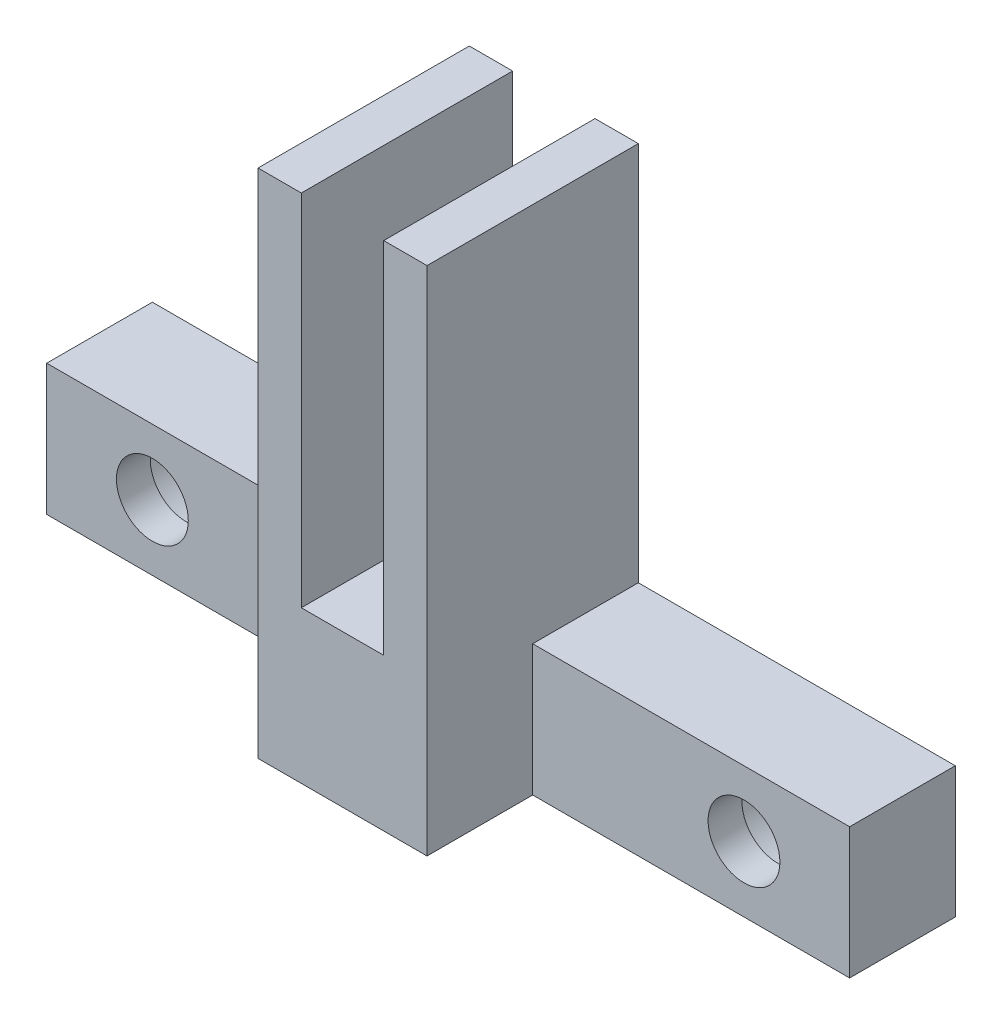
ISO-10303-21;
HEADER;
FILE_DESCRIPTION(('STEP AP214'),'2;1');
FILE_NAME('part.step','',(''),(''),'','','');
FILE_SCHEMA(('AUTOMOTIVE_DESIGN { 1 0 10303 214 1 1 1 1 }'));
ENDSEC;
DATA;
#1=APPLICATION_CONTEXT('core data for automotive mechanical design processes');
#2=APPLICATION_PROTOCOL_DEFINITION('international standard','automotive_design',2000,#1);
#3=PRODUCT_CONTEXT('',#1,'mechanical');
#4=PRODUCT('Part','Part','',(#3));
#5=PRODUCT_RELATED_PRODUCT_CATEGORY('part','',(#4));
#6=PRODUCT_DEFINITION_FORMATION('','',#4);
#7=PRODUCT_DEFINITION_CONTEXT('part definition',#1,'design');
#8=PRODUCT_DEFINITION('design','',#6,#7);
#9=PRODUCT_DEFINITION_SHAPE('','',#8);
#10=(LENGTH_UNIT() NAMED_UNIT(*) SI_UNIT(.MILLI.,.METRE.));
#11=(NAMED_UNIT(*) PLANE_ANGLE_UNIT() SI_UNIT($,.RADIAN.));
#12=(NAMED_UNIT(*) SI_UNIT($,.STERADIAN.) SOLID_ANGLE_UNIT());
#13=UNCERTAINTY_MEASURE_WITH_UNIT(LENGTH_MEASURE(1.E-05),#10,'distance_accuracy_value','');
#14=(GEOMETRIC_REPRESENTATION_CONTEXT(3) GLOBAL_UNCERTAINTY_ASSIGNED_CONTEXT((#13)) GLOBAL_UNIT_ASSIGNED_CONTEXT((#10,
#11,#12)) REPRESENTATION_CONTEXT('',''));
#15=CARTESIAN_POINT('',(0.,0.,0.));
#16=DIRECTION('',(0.,0.,1.));
#17=DIRECTION('',(1.,0.,0.));
#18=AXIS2_PLACEMENT_3D('',#15,#16,#17);
#19=CARTESIAN_POINT('',(-79.4828612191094,46.4290601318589,10.));
#20=DIRECTION('',(1.,0.,0.));
#21=DIRECTION('',(0.,0.,-1.));
#22=AXIS2_PLACEMENT_3D('',#19,#20,#21);
#23=PLANE('',#22);
#24=DIRECTION('',(0.,-1.,0.));
#25=VECTOR('',#24,1.);
#26=CARTESIAN_POINT('',(-79.4828612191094,46.4290601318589,0.));
#27=LINE('',#26,#25);
#28=CARTESIAN_POINT('',(-79.4828612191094,46.4290601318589,0.));
#29=VERTEX_POINT('',#28);
#30=CARTESIAN_POINT('',(-79.4828612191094,28.4290601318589,0.));
#31=VERTEX_POINT('',#30);
#32=EDGE_CURVE('E215',#29,#31,#27,.T.);
#33=ORIENTED_EDGE('',*,*,#32,.T.);
#34=DIRECTION('',(0.,0.,-1.));
#35=VECTOR('',#34,1.);
#36=CARTESIAN_POINT('',(-79.4828612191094,28.4290601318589,10.));
#37=LINE('',#36,#35);
#38=CARTESIAN_POINT('',(-79.4828612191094,28.4290601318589,5.));
#39=VERTEX_POINT('',#38);
#40=EDGE_CURVE('E11',#39,#31,#37,.T.);
#41=ORIENTED_EDGE('',*,*,#40,.F.);
#42=DIRECTION('',(0.,1.,0.));
#43=VECTOR('',#42,1.);
#44=CARTESIAN_POINT('',(-79.4828612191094,22.2290601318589,5.));
#45=LINE('',#44,#43);
#46=CARTESIAN_POINT('',(-79.4828612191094,22.2290601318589,5.));
#47=VERTEX_POINT('',#46);
#48=EDGE_CURVE('E172',#47,#39,#45,.T.);
#49=ORIENTED_EDGE('',*,*,#48,.F.);
#50=DIRECTION('',(0.,0.,-1.));
#51=VECTOR('',#50,1.);
#52=CARTESIAN_POINT('',(-79.4828612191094,22.2290601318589,10.));
#53=LINE('',#52,#51);
#54=CARTESIAN_POINT('',(-79.4828612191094,22.2290601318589,10.));
#55=VERTEX_POINT('',#54);
#56=EDGE_CURVE('E169',#55,#47,#53,.T.);
#57=ORIENTED_EDGE('',*,*,#56,.F.);
#58=DIRECTION('',(0.,-1.,0.));
#59=VECTOR('',#58,1.);
#60=CARTESIAN_POINT('',(-79.4828612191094,46.4290601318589,10.));
#61=LINE('',#60,#59);
#62=CARTESIAN_POINT('',(-79.4828612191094,46.4290601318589,10.));
#63=VERTEX_POINT('',#62);
#64=EDGE_CURVE('E270',#63,#55,#61,.T.);
#65=ORIENTED_EDGE('',*,*,#64,.F.);
#66=DIRECTION('',(0.,0.,-1.));
#67=VECTOR('',#66,1.);
#68=CARTESIAN_POINT('',(-79.4828612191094,46.4290601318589,10.));
#69=LINE('',#68,#67);
#70=EDGE_CURVE('E260',#63,#29,#69,.T.);
#71=ORIENTED_EDGE('',*,*,#70,.T.);
#72=EDGE_LOOP('',(#33,#41,#49,#57,#65,#71));
#73=FACE_BOUND('',#72,.T.);
#74=ADVANCED_FACE('F16',(#73),#23,.F.);
#75=CARTESIAN_POINT('',(-71.4828612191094,46.4290601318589,10.));
#76=DIRECTION('',(-1.,0.,0.));
#77=DIRECTION('',(0.,0.,1.));
#78=AXIS2_PLACEMENT_3D('',#75,#76,#77);
#79=PLANE('',#78);
#80=DIRECTION('',(0.,1.,0.));
#81=VECTOR('',#80,1.);
#82=CARTESIAN_POINT('',(-71.4828612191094,46.4290601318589,0.));
#83=LINE('',#82,#81);
#84=CARTESIAN_POINT('',(-71.4828612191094,28.4290601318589,0.));
#85=VERTEX_POINT('',#84);
#86=CARTESIAN_POINT('',(-71.4828612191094,46.4290601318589,0.));
#87=VERTEX_POINT('',#86);
#88=EDGE_CURVE('E232',#85,#87,#83,.T.);
#89=ORIENTED_EDGE('',*,*,#88,.T.);
#90=DIRECTION('',(0.,0.,-1.));
#91=VECTOR('',#90,1.);
#92=CARTESIAN_POINT('',(-71.4828612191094,46.4290601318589,10.));
#93=LINE('',#92,#91);
#94=CARTESIAN_POINT('',(-71.4828612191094,46.4290601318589,10.));
#95=VERTEX_POINT('',#94);
#96=EDGE_CURVE('E279',#95,#87,#93,.T.);
#97=ORIENTED_EDGE('',*,*,#96,.F.);
#98=DIRECTION('',(0.,1.,0.));
#99=VECTOR('',#98,1.);
#100=CARTESIAN_POINT('',(-71.4828612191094,46.4290601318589,10.));
#101=LINE('',#100,#99);
#102=CARTESIAN_POINT('',(-71.4828612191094,22.2290601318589,10.));
#103=VERTEX_POINT('',#102);
#104=EDGE_CURVE('E72',#103,#95,#101,.T.);
#105=ORIENTED_EDGE('',*,*,#104,.F.);
#106=DIRECTION('',(0.,0.,1.));
#107=VECTOR('',#106,1.);
#108=CARTESIAN_POINT('',(-71.4828612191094,22.2290601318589,10.));
#109=LINE('',#108,#107);
#110=CARTESIAN_POINT('',(-71.4828612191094,22.2290601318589,5.));
#111=VERTEX_POINT('',#110);
#112=EDGE_CURVE('E175',#111,#103,#109,.T.);
#113=ORIENTED_EDGE('',*,*,#112,.F.);
#114=DIRECTION('',(0.,1.,0.));
#115=VECTOR('',#114,1.);
#116=CARTESIAN_POINT('',(-71.4828612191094,22.2290601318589,5.));
#117=LINE('',#116,#115);
#118=CARTESIAN_POINT('',(-71.4828612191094,28.4290601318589,5.));
#119=VERTEX_POINT('',#118);
#120=EDGE_CURVE('E178',#111,#119,#117,.T.);
#121=ORIENTED_EDGE('',*,*,#120,.T.);
#122=DIRECTION('',(0.,0.,-1.));
#123=VECTOR('',#122,1.);
#124=CARTESIAN_POINT('',(-71.4828612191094,28.4290601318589,10.));
#125=LINE('',#124,#123);
#126=EDGE_CURVE('E24',#119,#85,#125,.T.);
#127=ORIENTED_EDGE('',*,*,#126,.T.);
#128=EDGE_LOOP('',(#89,#97,#105,#113,#121,#127));
#129=FACE_BOUND('',#128,.T.);
#130=ADVANCED_FACE('F301',(#129),#79,.F.);
#131=CARTESIAN_POINT('',(-73.5328612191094,46.4290601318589,10.));
#132=DIRECTION('',(0.,-1.,0.));
#133=DIRECTION('',(0.,0.,-1.));
#134=AXIS2_PLACEMENT_3D('',#131,#132,#133);
#135=PLANE('',#134);
#136=DIRECTION('',(-1.,0.,0.));
#137=VECTOR('',#136,1.);
#138=CARTESIAN_POINT('',(-73.5328612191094,46.4290601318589,0.));
#139=LINE('',#138,#137);
#140=CARTESIAN_POINT('',(-73.5328612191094,46.4290601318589,0.));
#141=VERTEX_POINT('',#140);
#142=EDGE_CURVE('E262',#87,#141,#139,.T.);
#143=ORIENTED_EDGE('',*,*,#142,.T.);
#144=DIRECTION('',(0.,0.,-1.));
#145=VECTOR('',#144,1.);
#146=CARTESIAN_POINT('',(-73.5328612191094,46.4290601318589,10.));
#147=LINE('',#146,#145);
#148=CARTESIAN_POINT('',(-73.5328612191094,46.4290601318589,10.));
#149=VERTEX_POINT('',#148);
#150=EDGE_CURVE('E284',#149,#141,#147,.T.);
#151=ORIENTED_EDGE('',*,*,#150,.F.);
#152=DIRECTION('',(-1.,0.,0.));
#153=VECTOR('',#152,1.);
#154=CARTESIAN_POINT('',(-73.5328612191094,46.4290601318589,10.));
#155=LINE('',#154,#153);
#156=EDGE_CURVE('E131',#95,#149,#155,.T.);
#157=ORIENTED_EDGE('',*,*,#156,.F.);
#158=ORIENTED_EDGE('',*,*,#96,.T.);
#159=EDGE_LOOP('',(#143,#151,#157,#158));
#160=FACE_BOUND('',#159,.T.);
#161=ADVANCED_FACE('F303',(#160),#135,.F.);
#162=CARTESIAN_POINT('',(-73.5328612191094,46.4290601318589,10.));
#163=DIRECTION('',(1.,0.,0.));
#164=DIRECTION('',(0.,0.,-1.));
#165=AXIS2_PLACEMENT_3D('',#162,#163,#164);
#166=PLANE('',#165);
#167=DIRECTION('',(0.,-1.,0.));
#168=VECTOR('',#167,1.);
#169=CARTESIAN_POINT('',(-73.5328612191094,46.4290601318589,0.));
#170=LINE('',#169,#168);
#171=CARTESIAN_POINT('',(-73.5328612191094,29.4290601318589,0.));
#172=VERTEX_POINT('',#171);
#173=EDGE_CURVE('E32',#141,#172,#170,.T.);
#174=ORIENTED_EDGE('',*,*,#173,.T.);
#175=DIRECTION('',(0.,0.,-1.));
#176=VECTOR('',#175,1.);
#177=CARTESIAN_POINT('',(-73.5328612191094,29.4290601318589,10.));
#178=LINE('',#177,#176);
#179=CARTESIAN_POINT('',(-73.5328612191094,29.4290601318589,10.));
#180=VERTEX_POINT('',#179);
#181=EDGE_CURVE('E135',#180,#172,#178,.T.);
#182=ORIENTED_EDGE('',*,*,#181,.F.);
#183=DIRECTION('',(0.,-1.,0.));
#184=VECTOR('',#183,1.);
#185=CARTESIAN_POINT('',(-73.5328612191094,46.4290601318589,10.));
#186=LINE('',#185,#184);
#187=EDGE_CURVE('E126',#149,#180,#186,.T.);
#188=ORIENTED_EDGE('',*,*,#187,.F.);
#189=ORIENTED_EDGE('',*,*,#150,.T.);
#190=EDGE_LOOP('',(#174,#182,#188,#189));
#191=FACE_BOUND('',#190,.T.);
#192=ADVANCED_FACE('F136',(#191),#166,.F.);
#193=CARTESIAN_POINT('',(-77.4328612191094,46.4290601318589,10.));
#194=DIRECTION('',(-1.,0.,0.));
#195=DIRECTION('',(0.,0.,1.));
#196=AXIS2_PLACEMENT_3D('',#193,#194,#195);
#197=PLANE('',#196);
#198=DIRECTION('',(0.,1.,0.));
#199=VECTOR('',#198,1.);
#200=CARTESIAN_POINT('',(-77.4328612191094,46.4290601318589,0.));
#201=LINE('',#200,#199);
#202=CARTESIAN_POINT('',(-77.4328612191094,29.4290601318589,0.));
#203=VERTEX_POINT('',#202);
#204=CARTESIAN_POINT('',(-77.4328612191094,46.4290601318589,0.));
#205=VERTEX_POINT('',#204);
#206=EDGE_CURVE('E290',#203,#205,#201,.T.);
#207=ORIENTED_EDGE('',*,*,#206,.T.);
#208=DIRECTION('',(0.,0.,-1.));
#209=VECTOR('',#208,1.);
#210=CARTESIAN_POINT('',(-77.4328612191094,46.4290601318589,10.));
#211=LINE('',#210,#209);
#212=CARTESIAN_POINT('',(-77.4328612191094,46.4290601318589,10.));
#213=VERTEX_POINT('',#212);
#214=EDGE_CURVE('E286',#213,#205,#211,.T.);
#215=ORIENTED_EDGE('',*,*,#214,.F.);
#216=DIRECTION('',(0.,1.,0.));
#217=VECTOR('',#216,1.);
#218=CARTESIAN_POINT('',(-77.4328612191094,46.4290601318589,10.));
#219=LINE('',#218,#217);
#220=CARTESIAN_POINT('',(-77.4328612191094,29.4290601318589,10.));
#221=VERTEX_POINT('',#220);
#222=EDGE_CURVE('E133',#221,#213,#219,.T.);
#223=ORIENTED_EDGE('',*,*,#222,.F.);
#224=DIRECTION('',(0.,0.,-1.));
#225=VECTOR('',#224,1.);
#226=CARTESIAN_POINT('',(-77.4328612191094,29.4290601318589,10.));
#227=LINE('',#226,#225);
#228=EDGE_CURVE('E140',#221,#203,#227,.T.);
#229=ORIENTED_EDGE('',*,*,#228,.T.);
#230=EDGE_LOOP('',(#207,#215,#223,#229));
#231=FACE_BOUND('',#230,.T.);
#232=ADVANCED_FACE('F297',(#231),#197,.F.);
#233=CARTESIAN_POINT('',(-79.4828612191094,46.4290601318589,10.));
#234=DIRECTION('',(0.,-1.,0.));
#235=DIRECTION('',(0.,0.,-1.));
#236=AXIS2_PLACEMENT_3D('',#233,#234,#235);
#237=PLANE('',#236);
#238=DIRECTION('',(-1.,0.,0.));
#239=VECTOR('',#238,1.);
#240=CARTESIAN_POINT('',(-79.4828612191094,46.4290601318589,0.));
#241=LINE('',#240,#239);
#242=EDGE_CURVE('E65',#205,#29,#241,.T.);
#243=ORIENTED_EDGE('',*,*,#242,.T.);
#244=ORIENTED_EDGE('',*,*,#70,.F.);
#245=DIRECTION('',(-1.,0.,0.));
#246=VECTOR('',#245,1.);
#247=CARTESIAN_POINT('',(-79.4828612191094,46.4290601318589,10.));
#248=LINE('',#247,#246);
#249=EDGE_CURVE('E41',#213,#63,#248,.T.);
#250=ORIENTED_EDGE('',*,*,#249,.F.);
#251=ORIENTED_EDGE('',*,*,#214,.T.);
#252=EDGE_LOOP('',(#243,#244,#250,#251));
#253=FACE_BOUND('',#252,.T.);
#254=ADVANCED_FACE('F298',(#253),#237,.F.);
#255=CARTESIAN_POINT('',(-79.4828612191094,28.4290601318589,10.));
#256=DIRECTION('',(0.,0.,1.));
#257=DIRECTION('',(1.,0.,0.));
#258=AXIS2_PLACEMENT_3D('',#255,#256,#257);
#259=PLANE('',#258);
#260=ORIENTED_EDGE('',*,*,#187,.T.);
#261=DIRECTION('',(-1.,0.,0.));
#262=VECTOR('',#261,1.);
#263=CARTESIAN_POINT('',(-73.5328612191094,29.4290601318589,10.));
#264=LINE('',#263,#262);
#265=EDGE_CURVE('E129',#180,#221,#264,.T.);
#266=ORIENTED_EDGE('',*,*,#265,.T.);
#267=ORIENTED_EDGE('',*,*,#222,.T.);
#268=ORIENTED_EDGE('',*,*,#249,.T.);
#269=ORIENTED_EDGE('',*,*,#64,.T.);
#270=DIRECTION('',(-1.,0.,0.));
#271=VECTOR('',#270,1.);
#272=CARTESIAN_POINT('',(-68.4828612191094,22.2290601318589,10.));
#273=LINE('',#272,#271);
#274=EDGE_CURVE('E212',#103,#55,#273,.T.);
#275=ORIENTED_EDGE('',*,*,#274,.F.);
#276=ORIENTED_EDGE('',*,*,#104,.T.);
#277=ORIENTED_EDGE('',*,*,#156,.T.);
#278=EDGE_LOOP('',(#260,#266,#267,#268,#269,#275,#276,#277));
#279=FACE_BOUND('',#278,.T.);
#280=ADVANCED_FACE('F127',(#279),#259,.T.);
#281=CARTESIAN_POINT('',(-79.4828612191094,28.4290601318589,0.));
#282=DIRECTION('',(0.,0.,1.));
#283=DIRECTION('',(1.,0.,0.));
#284=AXIS2_PLACEMENT_3D('',#281,#282,#283);
#285=PLANE('',#284);
#286=CARTESIAN_POINT('',(-89.4828612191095,25.3290601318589,0.));
#287=DIRECTION('',(0.,0.,-1.));
#288=DIRECTION('',(-1.,0.,0.));
#289=AXIS2_PLACEMENT_3D('',#286,#287,#288);
#290=CIRCLE('',#289,3.);
#291=CARTESIAN_POINT('',(-92.4828612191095,25.3290601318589,0.));
#292=VERTEX_POINT('',#291);
#293=EDGE_CURVE('E149',#292,#292,#290,.T.);
#294=ORIENTED_EDGE('',*,*,#293,.F.);
#295=EDGE_LOOP('',(#294));
#296=FACE_BOUND('',#295,.T.);
#297=CARTESIAN_POINT('',(-61.4828612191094,25.3290601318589,0.));
#298=DIRECTION('',(0.,0.,-1.));
#299=DIRECTION('',(-1.,0.,0.));
#300=AXIS2_PLACEMENT_3D('',#297,#298,#299);
#301=CIRCLE('',#300,3.);
#302=CARTESIAN_POINT('',(-64.4828612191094,25.3290601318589,0.));
#303=VERTEX_POINT('',#302);
#304=EDGE_CURVE('E159',#303,#303,#301,.T.);
#305=ORIENTED_EDGE('',*,*,#304,.F.);
#306=EDGE_LOOP('',(#305));
#307=FACE_BOUND('',#306,.T.);
#308=DIRECTION('',(-1.,0.,0.));
#309=VECTOR('',#308,1.);
#310=CARTESIAN_POINT('',(-73.5328612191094,29.4290601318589,0.));
#311=LINE('',#310,#309);
#312=EDGE_CURVE('E145',#172,#203,#311,.T.);
#313=ORIENTED_EDGE('',*,*,#312,.F.);
#314=ORIENTED_EDGE('',*,*,#173,.F.);
#315=ORIENTED_EDGE('',*,*,#142,.F.);
#316=ORIENTED_EDGE('',*,*,#88,.F.);
#317=DIRECTION('',(1.,0.,0.));
#318=VECTOR('',#317,1.);
#319=CARTESIAN_POINT('',(-79.4828612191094,28.4290601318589,0.));
#320=LINE('',#319,#318);
#321=CARTESIAN_POINT('',(-56.4828612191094,28.4290601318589,0.));
#322=VERTEX_POINT('',#321);
#323=EDGE_CURVE('E203',#85,#322,#320,.T.);
#324=ORIENTED_EDGE('',*,*,#323,.T.);
#325=DIRECTION('',(0.,-1.,0.));
#326=VECTOR('',#325,1.);
#327=CARTESIAN_POINT('',(-56.4828612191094,28.4290601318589,0.));
#328=LINE('',#327,#326);
#329=CARTESIAN_POINT('',(-56.4828612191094,22.2290601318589,0.));
#330=VERTEX_POINT('',#329);
#331=EDGE_CURVE('E186',#322,#330,#328,.T.);
#332=ORIENTED_EDGE('',*,*,#331,.T.);
#333=DIRECTION('',(-1.,0.,0.));
#334=VECTOR('',#333,1.);
#335=CARTESIAN_POINT('',(-68.4828612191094,22.2290601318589,0.));
#336=LINE('',#335,#334);
#337=CARTESIAN_POINT('',(-94.4828612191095,22.2290601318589,0.));
#338=VERTEX_POINT('',#337);
#339=EDGE_CURVE('E216',#330,#338,#336,.T.);
#340=ORIENTED_EDGE('',*,*,#339,.T.);
#341=DIRECTION('',(0.,1.,0.));
#342=VECTOR('',#341,1.);
#343=CARTESIAN_POINT('',(-94.4828612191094,28.4290601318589,0.));
#344=LINE('',#343,#342);
#345=CARTESIAN_POINT('',(-94.4828612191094,28.4290601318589,0.));
#346=VERTEX_POINT('',#345);
#347=EDGE_CURVE('E181',#338,#346,#344,.T.);
#348=ORIENTED_EDGE('',*,*,#347,.T.);
#349=EDGE_CURVE('E223',#346,#31,#320,.T.);
#350=ORIENTED_EDGE('',*,*,#349,.T.);
#351=ORIENTED_EDGE('',*,*,#32,.F.);
#352=ORIENTED_EDGE('',*,*,#242,.F.);
#353=ORIENTED_EDGE('',*,*,#206,.F.);
#354=EDGE_LOOP('',(#313,#314,#315,#316,#324,#332,#340,#348,#350,#351,#352,#353));
#355=FACE_BOUND('',#354,.T.);
#356=ADVANCED_FACE('F229',(#296,#307,#355),#285,.F.);
#357=CARTESIAN_POINT('',(-79.4828612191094,28.4290601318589,10.));
#358=DIRECTION('',(0.,1.,0.));
#359=DIRECTION('',(0.,0.,1.));
#360=AXIS2_PLACEMENT_3D('',#357,#358,#359);
#361=PLANE('',#360);
#362=ORIENTED_EDGE('',*,*,#126,.F.);
#363=DIRECTION('',(1.,0.,0.));
#364=VECTOR('',#363,1.);
#365=CARTESIAN_POINT('',(-94.4828612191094,28.4290601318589,5.));
#366=LINE('',#365,#364);
#367=CARTESIAN_POINT('',(-56.4828612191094,28.4290601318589,5.));
#368=VERTEX_POINT('',#367);
#369=EDGE_CURVE('E185',#119,#368,#366,.T.);
#370=ORIENTED_EDGE('',*,*,#369,.T.);
#371=DIRECTION('',(0.,0.,-1.));
#372=VECTOR('',#371,1.);
#373=CARTESIAN_POINT('',(-56.4828612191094,28.4290601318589,5.));
#374=LINE('',#373,#372);
#375=EDGE_CURVE('E207',#368,#322,#374,.T.);
#376=ORIENTED_EDGE('',*,*,#375,.T.);
#377=ORIENTED_EDGE('',*,*,#323,.F.);
#378=EDGE_LOOP('',(#362,#370,#376,#377));
#379=FACE_BOUND('',#378,.T.);
#380=ADVANCED_FACE('F236',(#379),#361,.T.);
#381=CARTESIAN_POINT('',(-68.4828612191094,22.2290601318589,10.));
#382=DIRECTION('',(0.,-1.,0.));
#383=DIRECTION('',(0.,0.,-1.));
#384=AXIS2_PLACEMENT_3D('',#381,#382,#383);
#385=PLANE('',#384);
#386=ORIENTED_EDGE('',*,*,#56,.T.);
#387=DIRECTION('',(-1.,0.,0.));
#388=VECTOR('',#387,1.);
#389=CARTESIAN_POINT('',(-94.4828612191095,22.2290601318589,5.));
#390=LINE('',#389,#388);
#391=CARTESIAN_POINT('',(-94.4828612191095,22.2290601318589,5.));
#392=VERTEX_POINT('',#391);
#393=EDGE_CURVE('E192',#47,#392,#390,.T.);
#394=ORIENTED_EDGE('',*,*,#393,.T.);
#395=DIRECTION('',(0.,0.,-1.));
#396=VECTOR('',#395,1.);
#397=CARTESIAN_POINT('',(-94.4828612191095,22.2290601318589,5.));
#398=LINE('',#397,#396);
#399=EDGE_CURVE('E200',#392,#338,#398,.T.);
#400=ORIENTED_EDGE('',*,*,#399,.T.);
#401=ORIENTED_EDGE('',*,*,#339,.F.);
#402=DIRECTION('',(0.,0.,-1.));
#403=VECTOR('',#402,1.);
#404=CARTESIAN_POINT('',(-56.4828612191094,22.2290601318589,5.));
#405=LINE('',#404,#403);
#406=CARTESIAN_POINT('',(-56.4828612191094,22.2290601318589,5.));
#407=VERTEX_POINT('',#406);
#408=EDGE_CURVE('E204',#407,#330,#405,.T.);
#409=ORIENTED_EDGE('',*,*,#408,.F.);
#410=EDGE_CURVE('E193',#407,#111,#390,.T.);
#411=ORIENTED_EDGE('',*,*,#410,.T.);
#412=ORIENTED_EDGE('',*,*,#112,.T.);
#413=ORIENTED_EDGE('',*,*,#274,.T.);
#414=EDGE_LOOP('',(#386,#394,#400,#401,#409,#411,#412,#413));
#415=FACE_BOUND('',#414,.T.);
#416=ADVANCED_FACE('F242',(#415),#385,.T.);
#417=CARTESIAN_POINT('',(-94.4828612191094,28.4290601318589,5.));
#418=VERTEX_POINT('',#417);
#419=EDGE_CURVE('E187',#418,#39,#366,.T.);
#420=ORIENTED_EDGE('',*,*,#419,.T.);
#421=ORIENTED_EDGE('',*,*,#40,.T.);
#422=ORIENTED_EDGE('',*,*,#349,.F.);
#423=DIRECTION('',(0.,0.,-1.));
#424=VECTOR('',#423,1.);
#425=CARTESIAN_POINT('',(-94.4828612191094,28.4290601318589,5.));
#426=LINE('',#425,#424);
#427=EDGE_CURVE('E195',#418,#346,#426,.T.);
#428=ORIENTED_EDGE('',*,*,#427,.F.);
#429=EDGE_LOOP('',(#420,#421,#422,#428));
#430=FACE_BOUND('',#429,.T.);
#431=ADVANCED_FACE('F251',(#430),#361,.T.);
#432=CARTESIAN_POINT('',(-56.4828612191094,28.4290601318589,5.));
#433=DIRECTION('',(1.,0.,0.));
#434=DIRECTION('',(0.,0.,-1.));
#435=AXIS2_PLACEMENT_3D('',#432,#433,#434);
#436=PLANE('',#435);
#437=ORIENTED_EDGE('',*,*,#331,.F.);
#438=ORIENTED_EDGE('',*,*,#375,.F.);
#439=DIRECTION('',(0.,-1.,0.));
#440=VECTOR('',#439,1.);
#441=CARTESIAN_POINT('',(-56.4828612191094,28.4290601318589,5.));
#442=LINE('',#441,#440);
#443=EDGE_CURVE('E189',#368,#407,#442,.T.);
#444=ORIENTED_EDGE('',*,*,#443,.T.);
#445=ORIENTED_EDGE('',*,*,#408,.T.);
#446=EDGE_LOOP('',(#437,#438,#444,#445));
#447=FACE_BOUND('',#446,.T.);
#448=ADVANCED_FACE('F239',(#447),#436,.T.);
#449=CARTESIAN_POINT('',(0.,0.,5.));
#450=DIRECTION('',(0.,0.,1.));
#451=DIRECTION('',(1.,0.,0.));
#452=AXIS2_PLACEMENT_3D('',#449,#450,#451);
#453=PLANE('',#452);
#454=CARTESIAN_POINT('',(-61.4828612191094,25.3290601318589,5.));
#455=DIRECTION('',(0.,0.,1.));
#456=DIRECTION('',(1.,0.,0.));
#457=AXIS2_PLACEMENT_3D('',#454,#455,#456);
#458=CIRCLE('',#457,1.7);
#459=CARTESIAN_POINT('',(-59.7828612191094,25.3290601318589,5.));
#460=VERTEX_POINT('',#459);
#461=EDGE_CURVE('E168',#460,#460,#458,.T.);
#462=ORIENTED_EDGE('',*,*,#461,.F.);
#463=EDGE_LOOP('',(#462));
#464=FACE_BOUND('',#463,.T.);
#465=ORIENTED_EDGE('',*,*,#369,.F.);
#466=ORIENTED_EDGE('',*,*,#120,.F.);
#467=ORIENTED_EDGE('',*,*,#410,.F.);
#468=ORIENTED_EDGE('',*,*,#443,.F.);
#469=EDGE_LOOP('',(#465,#466,#467,#468));
#470=FACE_BOUND('',#469,.T.);
#471=ADVANCED_FACE('F404',(#464,#470),#453,.T.);
#472=CARTESIAN_POINT('',(-89.4828612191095,25.3290601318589,5.));
#473=DIRECTION('',(0.,0.,1.));
#474=DIRECTION('',(1.,0.,0.));
#475=AXIS2_PLACEMENT_3D('',#472,#473,#474);
#476=CIRCLE('',#475,1.7);
#477=CARTESIAN_POINT('',(-87.7828612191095,25.3290601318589,5.));
#478=VERTEX_POINT('',#477);
#479=EDGE_CURVE('E19',#478,#478,#476,.T.);
#480=ORIENTED_EDGE('',*,*,#479,.F.);
#481=EDGE_LOOP('',(#480));
#482=FACE_BOUND('',#481,.T.);
#483=ORIENTED_EDGE('',*,*,#393,.F.);
#484=ORIENTED_EDGE('',*,*,#48,.T.);
#485=ORIENTED_EDGE('',*,*,#419,.F.);
#486=DIRECTION('',(0.,1.,0.));
#487=VECTOR('',#486,1.);
#488=CARTESIAN_POINT('',(-94.4828612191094,28.4290601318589,5.));
#489=LINE('',#488,#487);
#490=EDGE_CURVE('E182',#392,#418,#489,.T.);
#491=ORIENTED_EDGE('',*,*,#490,.F.);
#492=EDGE_LOOP('',(#483,#484,#485,#491));
#493=FACE_BOUND('',#492,.T.);
#494=ADVANCED_FACE('F253',(#482,#493),#453,.T.);
#495=CARTESIAN_POINT('',(-94.4828612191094,28.4290601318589,5.));
#496=DIRECTION('',(-1.,0.,0.));
#497=DIRECTION('',(0.,-1.,0.));
#498=AXIS2_PLACEMENT_3D('',#495,#496,#497);
#499=PLANE('',#498);
#500=ORIENTED_EDGE('',*,*,#347,.F.);
#501=ORIENTED_EDGE('',*,*,#399,.F.);
#502=ORIENTED_EDGE('',*,*,#490,.T.);
#503=ORIENTED_EDGE('',*,*,#427,.T.);
#504=EDGE_LOOP('',(#500,#501,#502,#503));
#505=FACE_BOUND('',#504,.T.);
#506=ADVANCED_FACE('F247',(#505),#499,.T.);
#507=CARTESIAN_POINT('',(-61.4828612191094,25.3290601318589,0.));
#508=DIRECTION('',(0.,0.,-1.));
#509=DIRECTION('',(-1.,0.,0.));
#510=AXIS2_PLACEMENT_3D('',#507,#508,#509);
#511=CYLINDRICAL_SURFACE('',#510,1.7);
#512=ORIENTED_EDGE('',*,*,#461,.T.);
#513=EDGE_LOOP('',(#512));
#514=FACE_BOUND('',#513,.T.);
#515=CARTESIAN_POINT('',(-61.4828612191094,25.3290601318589,3.4));
#516=DIRECTION('',(0.,0.,-1.));
#517=DIRECTION('',(-1.,0.,0.));
#518=AXIS2_PLACEMENT_3D('',#515,#516,#517);
#519=CIRCLE('',#518,1.7);
#520=CARTESIAN_POINT('',(-63.1828612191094,25.3290601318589,3.4));
#521=VERTEX_POINT('',#520);
#522=EDGE_CURVE('E165',#521,#521,#519,.T.);
#523=ORIENTED_EDGE('',*,*,#522,.T.);
#524=EDGE_LOOP('',(#523));
#525=FACE_BOUND('',#524,.T.);
#526=ADVANCED_FACE('F429',(#514,#525),#511,.F.);
#527=CARTESIAN_POINT('',(-59.7828612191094,25.3290601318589,3.4));
#528=DIRECTION('',(0.,0.,1.));
#529=DIRECTION('',(1.,0.,0.));
#530=AXIS2_PLACEMENT_3D('',#527,#528,#529);
#531=PLANE('',#530);
#532=ORIENTED_EDGE('',*,*,#522,.F.);
#533=EDGE_LOOP('',(#532));
#534=FACE_BOUND('',#533,.T.);
#535=CARTESIAN_POINT('',(-61.4828612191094,25.3290601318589,3.4));
#536=DIRECTION('',(0.,0.,-1.));
#537=DIRECTION('',(-1.,0.,0.));
#538=AXIS2_PLACEMENT_3D('',#535,#536,#537);
#539=CIRCLE('',#538,3.);
#540=CARTESIAN_POINT('',(-64.4828612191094,25.3290601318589,3.4));
#541=VERTEX_POINT('',#540);
#542=EDGE_CURVE('E162',#541,#541,#539,.T.);
#543=ORIENTED_EDGE('',*,*,#542,.T.);
#544=EDGE_LOOP('',(#543));
#545=FACE_BOUND('',#544,.T.);
#546=ADVANCED_FACE('F437',(#534,#545),#531,.F.);
#547=CARTESIAN_POINT('',(-61.4828612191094,25.3290601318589,0.));
#548=DIRECTION('',(0.,0.,-1.));
#549=DIRECTION('',(-1.,0.,0.));
#550=AXIS2_PLACEMENT_3D('',#547,#548,#549);
#551=CYLINDRICAL_SURFACE('',#550,3.);
#552=ORIENTED_EDGE('',*,*,#542,.F.);
#553=EDGE_LOOP('',(#552));
#554=FACE_BOUND('',#553,.T.);
#555=ORIENTED_EDGE('',*,*,#304,.T.);
#556=EDGE_LOOP('',(#555));
#557=FACE_BOUND('',#556,.T.);
#558=ADVANCED_FACE('F447',(#554,#557),#551,.F.);
#559=CARTESIAN_POINT('',(-89.4828612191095,25.3290601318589,0.));
#560=DIRECTION('',(0.,0.,-1.));
#561=DIRECTION('',(-1.,0.,0.));
#562=AXIS2_PLACEMENT_3D('',#559,#560,#561);
#563=CYLINDRICAL_SURFACE('',#562,1.7);
#564=ORIENTED_EDGE('',*,*,#479,.T.);
#565=EDGE_LOOP('',(#564));
#566=FACE_BOUND('',#565,.T.);
#567=CARTESIAN_POINT('',(-89.4828612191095,25.3290601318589,3.4));
#568=DIRECTION('',(0.,0.,-1.));
#569=DIRECTION('',(-1.,0.,0.));
#570=AXIS2_PLACEMENT_3D('',#567,#568,#569);
#571=CIRCLE('',#570,1.7);
#572=CARTESIAN_POINT('',(-91.1828612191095,25.3290601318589,3.4));
#573=VERTEX_POINT('',#572);
#574=EDGE_CURVE('E156',#573,#573,#571,.T.);
#575=ORIENTED_EDGE('',*,*,#574,.T.);
#576=EDGE_LOOP('',(#575));
#577=FACE_BOUND('',#576,.T.);
#578=ADVANCED_FACE('F457',(#566,#577),#563,.F.);
#579=CARTESIAN_POINT('',(-87.7828612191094,25.3290601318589,3.4));
#580=DIRECTION('',(0.,0.,1.));
#581=DIRECTION('',(1.,0.,0.));
#582=AXIS2_PLACEMENT_3D('',#579,#580,#581);
#583=PLANE('',#582);
#584=ORIENTED_EDGE('',*,*,#574,.F.);
#585=EDGE_LOOP('',(#584));
#586=FACE_BOUND('',#585,.T.);
#587=CARTESIAN_POINT('',(-89.4828612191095,25.3290601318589,3.4));
#588=DIRECTION('',(0.,0.,-1.));
#589=DIRECTION('',(-1.,0.,0.));
#590=AXIS2_PLACEMENT_3D('',#587,#588,#589);
#591=CIRCLE('',#590,3.);
#592=CARTESIAN_POINT('',(-92.4828612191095,25.3290601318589,3.4));
#593=VERTEX_POINT('',#592);
#594=EDGE_CURVE('E153',#593,#593,#591,.T.);
#595=ORIENTED_EDGE('',*,*,#594,.T.);
#596=EDGE_LOOP('',(#595));
#597=FACE_BOUND('',#596,.T.);
#598=ADVANCED_FACE('F467',(#586,#597),#583,.F.);
#599=CARTESIAN_POINT('',(-89.4828612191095,25.3290601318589,0.));
#600=DIRECTION('',(0.,0.,-1.));
#601=DIRECTION('',(-1.,0.,0.));
#602=AXIS2_PLACEMENT_3D('',#599,#600,#601);
#603=CYLINDRICAL_SURFACE('',#602,3.);
#604=ORIENTED_EDGE('',*,*,#594,.F.);
#605=EDGE_LOOP('',(#604));
#606=FACE_BOUND('',#605,.T.);
#607=ORIENTED_EDGE('',*,*,#293,.T.);
#608=EDGE_LOOP('',(#607));
#609=FACE_BOUND('',#608,.T.);
#610=ADVANCED_FACE('F477',(#606,#609),#603,.F.);
#611=CARTESIAN_POINT('',(-73.5328612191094,29.4290601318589,10.));
#612=DIRECTION('',(0.,-1.,0.));
#613=DIRECTION('',(0.,0.,-1.));
#614=AXIS2_PLACEMENT_3D('',#611,#612,#613);
#615=PLANE('',#614);
#616=ORIENTED_EDGE('',*,*,#312,.T.);
#617=ORIENTED_EDGE('',*,*,#228,.F.);
#618=ORIENTED_EDGE('',*,*,#265,.F.);
#619=ORIENTED_EDGE('',*,*,#181,.T.);
#620=EDGE_LOOP('',(#616,#617,#618,#619));
#621=FACE_BOUND('',#620,.T.);
#622=ADVANCED_FACE('F143',(#621),#615,.F.);
#623=CLOSED_SHELL('',(#74,#130,#161,#192,#232,#254,#280,#356,#380,#416,#431,#448,#471,#494,#506,
#526,#546,#558,#578,#598,#610,#622));
#624=MANIFOLD_SOLID_BREP('B1',#623);
#625=ADVANCED_BREP_SHAPE_REPRESENTATION('',(#18,#624),#14);
#626=SHAPE_DEFINITION_REPRESENTATION(#9,#625);
ENDSEC;
END-ISO-10303-21;
